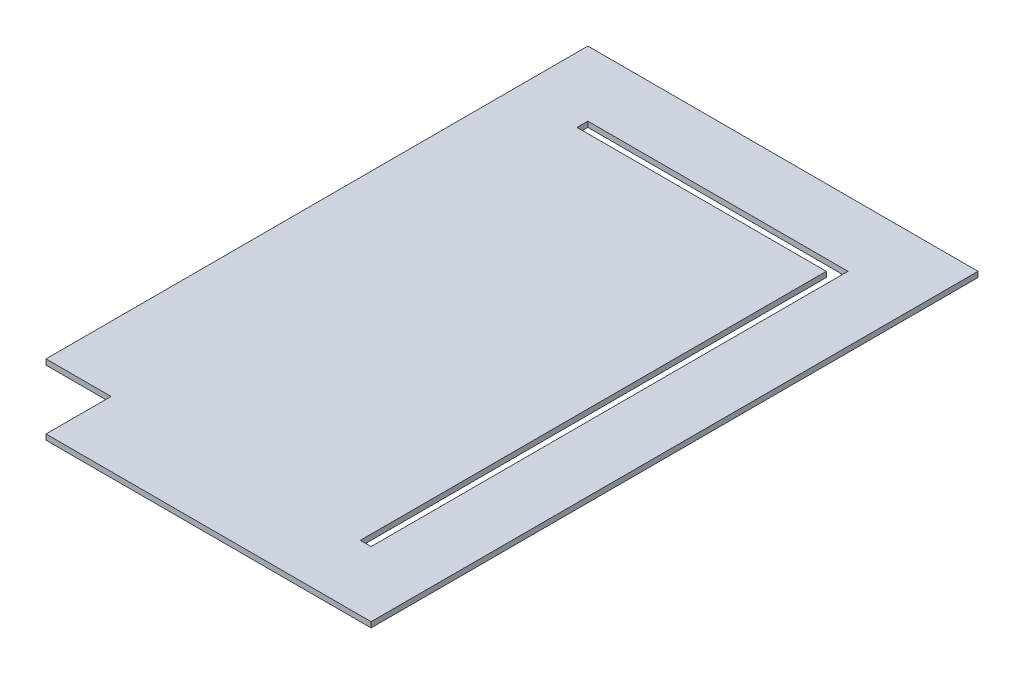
ISO-10303-21;
HEADER;
FILE_DESCRIPTION(('STEP AP214'),'2;1');
FILE_NAME('part.step','',(''),(''),'','','');
FILE_SCHEMA(('AUTOMOTIVE_DESIGN { 1 0 10303 214 1 1 1 1 }'));
ENDSEC;
DATA;
#1=APPLICATION_CONTEXT('core data for automotive mechanical design processes');
#2=APPLICATION_PROTOCOL_DEFINITION('international standard','automotive_design',2000,#1);
#3=PRODUCT_CONTEXT('',#1,'mechanical');
#4=PRODUCT('Part','Part','',(#3));
#5=PRODUCT_RELATED_PRODUCT_CATEGORY('part','',(#4));
#6=PRODUCT_DEFINITION_FORMATION('','',#4);
#7=PRODUCT_DEFINITION_CONTEXT('part definition',#1,'design');
#8=PRODUCT_DEFINITION('design','',#6,#7);
#9=PRODUCT_DEFINITION_SHAPE('','',#8);
#10=(LENGTH_UNIT() NAMED_UNIT(*) SI_UNIT(.MILLI.,.METRE.));
#11=(NAMED_UNIT(*) PLANE_ANGLE_UNIT() SI_UNIT($,.RADIAN.));
#12=(NAMED_UNIT(*) SI_UNIT($,.STERADIAN.) SOLID_ANGLE_UNIT());
#13=UNCERTAINTY_MEASURE_WITH_UNIT(LENGTH_MEASURE(1.E-05),#10,'distance_accuracy_value','');
#14=(GEOMETRIC_REPRESENTATION_CONTEXT(3) GLOBAL_UNCERTAINTY_ASSIGNED_CONTEXT((#13)) GLOBAL_UNIT_ASSIGNED_CONTEXT((#10,
#11,#12)) REPRESENTATION_CONTEXT('',''));
#15=CARTESIAN_POINT('',(0.,0.,0.));
#16=DIRECTION('',(0.,0.,1.));
#17=DIRECTION('',(1.,0.,0.));
#18=AXIS2_PLACEMENT_3D('',#15,#16,#17);
#19=CARTESIAN_POINT('',(0.,3.175,0.));
#20=DIRECTION('',(0.,-1.,0.));
#21=DIRECTION('',(0.,0.,-1.));
#22=AXIS2_PLACEMENT_3D('',#19,#20,#21);
#23=PLANE('',#22);
#24=DIRECTION('',(0.,0.,1.));
#25=VECTOR('',#24,1.);
#26=CARTESIAN_POINT('',(-114.3,3.175,177.8));
#27=LINE('',#26,#25);
#28=CARTESIAN_POINT('',(-114.3,3.175,-177.8));
#29=VERTEX_POINT('',#28);
#30=CARTESIAN_POINT('',(-114.3,3.175,139.7));
#31=VERTEX_POINT('',#30);
#32=EDGE_CURVE('E232',#29,#31,#27,.T.);
#33=ORIENTED_EDGE('',*,*,#32,.T.);
#34=DIRECTION('',(-1.,0.,0.));
#35=VECTOR('',#34,1.);
#36=CARTESIAN_POINT('',(-114.3,3.175,139.7));
#37=LINE('',#36,#35);
#38=CARTESIAN_POINT('',(-76.2,3.175,139.7));
#39=VERTEX_POINT('',#38);
#40=EDGE_CURVE('E175',#39,#31,#37,.T.);
#41=ORIENTED_EDGE('',*,*,#40,.F.);
#42=DIRECTION('',(0.,0.,-1.));
#43=VECTOR('',#42,1.);
#44=CARTESIAN_POINT('',(-76.2,3.175,177.8));
#45=LINE('',#44,#43);
#46=CARTESIAN_POINT('',(-76.2,3.175,177.8));
#47=VERTEX_POINT('',#46);
#48=EDGE_CURVE('E156',#47,#39,#45,.T.);
#49=ORIENTED_EDGE('',*,*,#48,.F.);
#50=DIRECTION('',(1.,0.,0.));
#51=VECTOR('',#50,1.);
#52=CARTESIAN_POINT('',(-114.3,3.175,177.8));
#53=LINE('',#52,#51);
#54=CARTESIAN_POINT('',(114.3,3.175,177.8));
#55=VERTEX_POINT('',#54);
#56=EDGE_CURVE('E235',#47,#55,#53,.T.);
#57=ORIENTED_EDGE('',*,*,#56,.T.);
#58=DIRECTION('',(0.,0.,-1.));
#59=VECTOR('',#58,1.);
#60=CARTESIAN_POINT('',(114.3,3.175,177.8));
#61=LINE('',#60,#59);
#62=CARTESIAN_POINT('',(114.3,3.175,-177.8));
#63=VERTEX_POINT('',#62);
#64=EDGE_CURVE('E227',#55,#63,#61,.T.);
#65=ORIENTED_EDGE('',*,*,#64,.T.);
#66=DIRECTION('',(-1.,0.,0.));
#67=VECTOR('',#66,1.);
#68=CARTESIAN_POINT('',(-114.3,3.175,-177.8));
#69=LINE('',#68,#67);
#70=EDGE_CURVE('E230',#63,#29,#69,.T.);
#71=ORIENTED_EDGE('',*,*,#70,.T.);
#72=EDGE_LOOP('',(#33,#41,#49,#57,#65,#71));
#73=FACE_BOUND('',#72,.T.);
#74=DIRECTION('',(1.,0.,0.));
#75=VECTOR('',#74,1.);
#76=CARTESIAN_POINT('',(-76.2,3.175,-139.7));
#77=LINE('',#76,#75);
#78=CARTESIAN_POINT('',(-76.2,3.175,-139.7));
#79=VERTEX_POINT('',#78);
#80=CARTESIAN_POINT('',(76.2,3.175,-139.7));
#81=VERTEX_POINT('',#80);
#82=EDGE_CURVE('E200',#79,#81,#77,.T.);
#83=ORIENTED_EDGE('',*,*,#82,.T.);
#84=DIRECTION('',(0.,0.,1.));
#85=VECTOR('',#84,1.);
#86=CARTESIAN_POINT('',(76.2,3.175,-139.7));
#87=LINE('',#86,#85);
#88=CARTESIAN_POINT('',(76.2000000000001,3.175,139.7));
#89=VERTEX_POINT('',#88);
#90=EDGE_CURVE('E196',#81,#89,#87,.T.);
#91=ORIENTED_EDGE('',*,*,#90,.T.);
#92=DIRECTION('',(-1.,0.,0.));
#93=VECTOR('',#92,1.);
#94=CARTESIAN_POINT('',(76.2000000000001,3.175,139.7));
#95=LINE('',#94,#93);
#96=CARTESIAN_POINT('',(69.85,3.175,139.7));
#97=VERTEX_POINT('',#96);
#98=EDGE_CURVE('E180',#89,#97,#95,.T.);
#99=ORIENTED_EDGE('',*,*,#98,.T.);
#100=DIRECTION('',(0.,0.,1.));
#101=VECTOR('',#100,1.);
#102=CARTESIAN_POINT('',(69.85,3.175,-133.35));
#103=LINE('',#102,#101);
#104=CARTESIAN_POINT('',(69.85,3.175,-133.35));
#105=VERTEX_POINT('',#104);
#106=EDGE_CURVE('E215',#105,#97,#103,.T.);
#107=ORIENTED_EDGE('',*,*,#106,.F.);
#108=DIRECTION('',(1.,0.,0.));
#109=VECTOR('',#108,1.);
#110=CARTESIAN_POINT('',(-76.2,3.175,-133.35));
#111=LINE('',#110,#109);
#112=CARTESIAN_POINT('',(-76.2,3.175,-133.35));
#113=VERTEX_POINT('',#112);
#114=EDGE_CURVE('E88',#113,#105,#111,.T.);
#115=ORIENTED_EDGE('',*,*,#114,.F.);
#116=DIRECTION('',(0.,0.,1.));
#117=VECTOR('',#116,1.);
#118=CARTESIAN_POINT('',(-76.2,3.175,-139.7));
#119=LINE('',#118,#117);
#120=EDGE_CURVE('E187',#79,#113,#119,.T.);
#121=ORIENTED_EDGE('',*,*,#120,.F.);
#122=EDGE_LOOP('',(#83,#91,#99,#107,#115,#121));
#123=FACE_BOUND('',#122,.T.);
#124=ADVANCED_FACE('F65',(#73,#123),#23,.F.);
#125=CARTESIAN_POINT('',(0.,0.,0.));
#126=DIRECTION('',(0.,-1.,0.));
#127=DIRECTION('',(0.,0.,-1.));
#128=AXIS2_PLACEMENT_3D('',#125,#126,#127);
#129=PLANE('',#128);
#130=DIRECTION('',(-1.,0.,0.));
#131=VECTOR('',#130,1.);
#132=CARTESIAN_POINT('',(-114.3,0.,139.7));
#133=LINE('',#132,#131);
#134=CARTESIAN_POINT('',(-76.2,0.,139.7));
#135=VERTEX_POINT('',#134);
#136=CARTESIAN_POINT('',(-114.3,0.,139.7));
#137=VERTEX_POINT('',#136);
#138=EDGE_CURVE('E163',#135,#137,#133,.T.);
#139=ORIENTED_EDGE('',*,*,#138,.T.);
#140=DIRECTION('',(0.,0.,1.));
#141=VECTOR('',#140,1.);
#142=CARTESIAN_POINT('',(-114.3,0.,177.8));
#143=LINE('',#142,#141);
#144=CARTESIAN_POINT('',(-114.3,0.,-177.8));
#145=VERTEX_POINT('',#144);
#146=EDGE_CURVE('E242',#145,#137,#143,.T.);
#147=ORIENTED_EDGE('',*,*,#146,.F.);
#148=DIRECTION('',(-1.,0.,0.));
#149=VECTOR('',#148,1.);
#150=CARTESIAN_POINT('',(-114.3,0.,-177.8));
#151=LINE('',#150,#149);
#152=CARTESIAN_POINT('',(114.3,0.,-177.8));
#153=VERTEX_POINT('',#152);
#154=EDGE_CURVE('E240',#153,#145,#151,.T.);
#155=ORIENTED_EDGE('',*,*,#154,.F.);
#156=DIRECTION('',(0.,0.,-1.));
#157=VECTOR('',#156,1.);
#158=CARTESIAN_POINT('',(114.3,0.,177.8));
#159=LINE('',#158,#157);
#160=CARTESIAN_POINT('',(114.3,0.,177.8));
#161=VERTEX_POINT('',#160);
#162=EDGE_CURVE('E225',#161,#153,#159,.T.);
#163=ORIENTED_EDGE('',*,*,#162,.F.);
#164=DIRECTION('',(1.,0.,0.));
#165=VECTOR('',#164,1.);
#166=CARTESIAN_POINT('',(-114.3,0.,177.8));
#167=LINE('',#166,#165);
#168=CARTESIAN_POINT('',(-76.2,0.,177.8));
#169=VERTEX_POINT('',#168);
#170=EDGE_CURVE('E174',#169,#161,#167,.T.);
#171=ORIENTED_EDGE('',*,*,#170,.F.);
#172=DIRECTION('',(0.,0.,-1.));
#173=VECTOR('',#172,1.);
#174=CARTESIAN_POINT('',(-76.2,0.,177.8));
#175=LINE('',#174,#173);
#176=EDGE_CURVE('E80',#169,#135,#175,.T.);
#177=ORIENTED_EDGE('',*,*,#176,.T.);
#178=EDGE_LOOP('',(#139,#147,#155,#163,#171,#177));
#179=FACE_BOUND('',#178,.T.);
#180=DIRECTION('',(0.,0.,1.));
#181=VECTOR('',#180,1.);
#182=CARTESIAN_POINT('',(76.2,0.,-139.7));
#183=LINE('',#182,#181);
#184=CARTESIAN_POINT('',(76.2,0.,-139.7));
#185=VERTEX_POINT('',#184);
#186=CARTESIAN_POINT('',(76.2000000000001,0.,139.7));
#187=VERTEX_POINT('',#186);
#188=EDGE_CURVE('E186',#185,#187,#183,.T.);
#189=ORIENTED_EDGE('',*,*,#188,.F.);
#190=DIRECTION('',(1.,0.,0.));
#191=VECTOR('',#190,1.);
#192=CARTESIAN_POINT('',(-76.2,0.,-139.7));
#193=LINE('',#192,#191);
#194=CARTESIAN_POINT('',(-76.2,0.,-139.7));
#195=VERTEX_POINT('',#194);
#196=EDGE_CURVE('E189',#195,#185,#193,.T.);
#197=ORIENTED_EDGE('',*,*,#196,.F.);
#198=DIRECTION('',(0.,0.,1.));
#199=VECTOR('',#198,1.);
#200=CARTESIAN_POINT('',(-76.2,0.,-139.7));
#201=LINE('',#200,#199);
#202=CARTESIAN_POINT('',(-76.2,0.,-133.35));
#203=VERTEX_POINT('',#202);
#204=EDGE_CURVE('E191',#195,#203,#201,.T.);
#205=ORIENTED_EDGE('',*,*,#204,.T.);
#206=DIRECTION('',(1.,0.,0.));
#207=VECTOR('',#206,1.);
#208=CARTESIAN_POINT('',(-76.2,0.,-133.35));
#209=LINE('',#208,#207);
#210=CARTESIAN_POINT('',(69.8499999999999,0.,-133.35));
#211=VERTEX_POINT('',#210);
#212=EDGE_CURVE('E183',#203,#211,#209,.T.);
#213=ORIENTED_EDGE('',*,*,#212,.T.);
#214=DIRECTION('',(0.,0.,1.));
#215=VECTOR('',#214,1.);
#216=CARTESIAN_POINT('',(69.85,0.,-133.35));
#217=LINE('',#216,#215);
#218=CARTESIAN_POINT('',(69.85,0.,139.7));
#219=VERTEX_POINT('',#218);
#220=EDGE_CURVE('E214',#211,#219,#217,.T.);
#221=ORIENTED_EDGE('',*,*,#220,.T.);
#222=DIRECTION('',(-1.,0.,0.));
#223=VECTOR('',#222,1.);
#224=CARTESIAN_POINT('',(76.2000000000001,0.,139.7));
#225=LINE('',#224,#223);
#226=EDGE_CURVE('E211',#187,#219,#225,.T.);
#227=ORIENTED_EDGE('',*,*,#226,.F.);
#228=EDGE_LOOP('',(#189,#197,#205,#213,#221,#227));
#229=FACE_BOUND('',#228,.T.);
#230=ADVANCED_FACE('F171',(#179,#229),#129,.T.);
#231=CARTESIAN_POINT('',(114.3,3.175,177.8));
#232=DIRECTION('',(-1.,0.,0.));
#233=DIRECTION('',(0.,0.,1.));
#234=AXIS2_PLACEMENT_3D('',#231,#232,#233);
#235=PLANE('',#234);
#236=ORIENTED_EDGE('',*,*,#162,.T.);
#237=DIRECTION('',(0.,-1.,0.));
#238=VECTOR('',#237,1.);
#239=CARTESIAN_POINT('',(114.3,3.175,-177.8));
#240=LINE('',#239,#238);
#241=EDGE_CURVE('E12',#63,#153,#240,.T.);
#242=ORIENTED_EDGE('',*,*,#241,.F.);
#243=ORIENTED_EDGE('',*,*,#64,.F.);
#244=DIRECTION('',(0.,-1.,0.));
#245=VECTOR('',#244,1.);
#246=CARTESIAN_POINT('',(114.3,3.175,177.8));
#247=LINE('',#246,#245);
#248=EDGE_CURVE('E237',#55,#161,#247,.T.);
#249=ORIENTED_EDGE('',*,*,#248,.T.);
#250=EDGE_LOOP('',(#236,#242,#243,#249));
#251=FACE_BOUND('',#250,.T.);
#252=ADVANCED_FACE('F67',(#251),#235,.F.);
#253=CARTESIAN_POINT('',(-114.3,3.175,-177.8));
#254=DIRECTION('',(0.,0.,1.));
#255=DIRECTION('',(1.,0.,0.));
#256=AXIS2_PLACEMENT_3D('',#253,#254,#255);
#257=PLANE('',#256);
#258=ORIENTED_EDGE('',*,*,#154,.T.);
#259=DIRECTION('',(0.,-1.,0.));
#260=VECTOR('',#259,1.);
#261=CARTESIAN_POINT('',(-114.3,3.175,-177.8));
#262=LINE('',#261,#260);
#263=EDGE_CURVE('E73',#29,#145,#262,.T.);
#264=ORIENTED_EDGE('',*,*,#263,.F.);
#265=ORIENTED_EDGE('',*,*,#70,.F.);
#266=ORIENTED_EDGE('',*,*,#241,.T.);
#267=EDGE_LOOP('',(#258,#264,#265,#266));
#268=FACE_BOUND('',#267,.T.);
#269=ADVANCED_FACE('F253',(#268),#257,.F.);
#270=CARTESIAN_POINT('',(-114.3,3.175,177.8));
#271=DIRECTION('',(1.,0.,0.));
#272=DIRECTION('',(0.,0.,-1.));
#273=AXIS2_PLACEMENT_3D('',#270,#271,#272);
#274=PLANE('',#273);
#275=ORIENTED_EDGE('',*,*,#146,.T.);
#276=DIRECTION('',(0.,1.,0.));
#277=VECTOR('',#276,1.);
#278=CARTESIAN_POINT('',(-114.3,0.,139.7));
#279=LINE('',#278,#277);
#280=EDGE_CURVE('E159',#137,#31,#279,.T.);
#281=ORIENTED_EDGE('',*,*,#280,.T.);
#282=ORIENTED_EDGE('',*,*,#32,.F.);
#283=ORIENTED_EDGE('',*,*,#263,.T.);
#284=EDGE_LOOP('',(#275,#281,#282,#283));
#285=FACE_BOUND('',#284,.T.);
#286=ADVANCED_FACE('F250',(#285),#274,.F.);
#287=CARTESIAN_POINT('',(-114.3,3.175,177.8));
#288=DIRECTION('',(0.,0.,-1.));
#289=DIRECTION('',(-1.,0.,0.));
#290=AXIS2_PLACEMENT_3D('',#287,#288,#289);
#291=PLANE('',#290);
#292=ORIENTED_EDGE('',*,*,#56,.F.);
#293=DIRECTION('',(0.,1.,0.));
#294=VECTOR('',#293,1.);
#295=CARTESIAN_POINT('',(-76.2,0.,177.8));
#296=LINE('',#295,#294);
#297=EDGE_CURVE('E160',#169,#47,#296,.T.);
#298=ORIENTED_EDGE('',*,*,#297,.F.);
#299=ORIENTED_EDGE('',*,*,#170,.T.);
#300=ORIENTED_EDGE('',*,*,#248,.F.);
#301=EDGE_LOOP('',(#292,#298,#299,#300));
#302=FACE_BOUND('',#301,.T.);
#303=ADVANCED_FACE('F259',(#302),#291,.F.);
#304=CARTESIAN_POINT('',(-76.2,0.,-139.7));
#305=DIRECTION('',(0.,0.,1.));
#306=DIRECTION('',(1.,0.,0.));
#307=AXIS2_PLACEMENT_3D('',#304,#305,#306);
#308=PLANE('',#307);
#309=ORIENTED_EDGE('',*,*,#82,.F.);
#310=DIRECTION('',(0.,1.,0.));
#311=VECTOR('',#310,1.);
#312=CARTESIAN_POINT('',(-76.2,0.,-139.7));
#313=LINE('',#312,#311);
#314=EDGE_CURVE('E208',#195,#79,#313,.T.);
#315=ORIENTED_EDGE('',*,*,#314,.F.);
#316=ORIENTED_EDGE('',*,*,#196,.T.);
#317=DIRECTION('',(0.,1.,0.));
#318=VECTOR('',#317,1.);
#319=CARTESIAN_POINT('',(76.2,0.,-139.7));
#320=LINE('',#319,#318);
#321=EDGE_CURVE('E194',#185,#81,#320,.T.);
#322=ORIENTED_EDGE('',*,*,#321,.T.);
#323=EDGE_LOOP('',(#309,#315,#316,#322));
#324=FACE_BOUND('',#323,.T.);
#325=ADVANCED_FACE('F268',(#324),#308,.T.);
#326=CARTESIAN_POINT('',(-76.2,0.,-139.7));
#327=DIRECTION('',(-1.,0.,0.));
#328=DIRECTION('',(0.,0.,1.));
#329=AXIS2_PLACEMENT_3D('',#326,#327,#328);
#330=PLANE('',#329);
#331=ORIENTED_EDGE('',*,*,#120,.T.);
#332=DIRECTION('',(0.,1.,0.));
#333=VECTOR('',#332,1.);
#334=CARTESIAN_POINT('',(-76.2,0.,-133.35));
#335=LINE('',#334,#333);
#336=EDGE_CURVE('E205',#203,#113,#335,.T.);
#337=ORIENTED_EDGE('',*,*,#336,.F.);
#338=ORIENTED_EDGE('',*,*,#204,.F.);
#339=ORIENTED_EDGE('',*,*,#314,.T.);
#340=EDGE_LOOP('',(#331,#337,#338,#339));
#341=FACE_BOUND('',#340,.T.);
#342=ADVANCED_FACE('F287',(#341),#330,.F.);
#343=CARTESIAN_POINT('',(-76.2,0.,-133.35));
#344=DIRECTION('',(0.,0.,1.));
#345=DIRECTION('',(1.,0.,0.));
#346=AXIS2_PLACEMENT_3D('',#343,#344,#345);
#347=PLANE('',#346);
#348=ORIENTED_EDGE('',*,*,#212,.F.);
#349=ORIENTED_EDGE('',*,*,#336,.T.);
#350=ORIENTED_EDGE('',*,*,#114,.T.);
#351=DIRECTION('',(0.,1.,0.));
#352=VECTOR('',#351,1.);
#353=CARTESIAN_POINT('',(69.85,0.,-133.35));
#354=LINE('',#353,#352);
#355=EDGE_CURVE('E207',#211,#105,#354,.T.);
#356=ORIENTED_EDGE('',*,*,#355,.F.);
#357=EDGE_LOOP('',(#348,#349,#350,#356));
#358=FACE_BOUND('',#357,.T.);
#359=ADVANCED_FACE('F285',(#358),#347,.F.);
#360=CARTESIAN_POINT('',(76.2,0.,-139.7));
#361=DIRECTION('',(-1.,0.,0.));
#362=DIRECTION('',(0.,0.,1.));
#363=AXIS2_PLACEMENT_3D('',#360,#361,#362);
#364=PLANE('',#363);
#365=ORIENTED_EDGE('',*,*,#90,.F.);
#366=ORIENTED_EDGE('',*,*,#321,.F.);
#367=ORIENTED_EDGE('',*,*,#188,.T.);
#368=DIRECTION('',(0.,1.,0.));
#369=VECTOR('',#368,1.);
#370=CARTESIAN_POINT('',(76.2000000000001,0.,139.7));
#371=LINE('',#370,#369);
#372=EDGE_CURVE('E218',#187,#89,#371,.T.);
#373=ORIENTED_EDGE('',*,*,#372,.T.);
#374=EDGE_LOOP('',(#365,#366,#367,#373));
#375=FACE_BOUND('',#374,.T.);
#376=ADVANCED_FACE('F274',(#375),#364,.T.);
#377=CARTESIAN_POINT('',(76.2000000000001,0.,139.7));
#378=DIRECTION('',(0.,0.,-1.));
#379=DIRECTION('',(-1.,0.,0.));
#380=AXIS2_PLACEMENT_3D('',#377,#378,#379);
#381=PLANE('',#380);
#382=ORIENTED_EDGE('',*,*,#98,.F.);
#383=ORIENTED_EDGE('',*,*,#372,.F.);
#384=ORIENTED_EDGE('',*,*,#226,.T.);
#385=DIRECTION('',(0.,1.,0.));
#386=VECTOR('',#385,1.);
#387=CARTESIAN_POINT('',(69.85,0.,139.7));
#388=LINE('',#387,#386);
#389=EDGE_CURVE('E197',#219,#97,#388,.T.);
#390=ORIENTED_EDGE('',*,*,#389,.T.);
#391=EDGE_LOOP('',(#382,#383,#384,#390));
#392=FACE_BOUND('',#391,.T.);
#393=ADVANCED_FACE('F279',(#392),#381,.T.);
#394=CARTESIAN_POINT('',(69.85,0.,-133.35));
#395=DIRECTION('',(-1.,0.,0.));
#396=DIRECTION('',(0.,0.,1.));
#397=AXIS2_PLACEMENT_3D('',#394,#395,#396);
#398=PLANE('',#397);
#399=ORIENTED_EDGE('',*,*,#106,.T.);
#400=ORIENTED_EDGE('',*,*,#389,.F.);
#401=ORIENTED_EDGE('',*,*,#220,.F.);
#402=ORIENTED_EDGE('',*,*,#355,.T.);
#403=EDGE_LOOP('',(#399,#400,#401,#402));
#404=FACE_BOUND('',#403,.T.);
#405=ADVANCED_FACE('F282',(#404),#398,.F.);
#406=CARTESIAN_POINT('',(-114.3,0.,139.7));
#407=DIRECTION('',(0.,0.,-1.));
#408=DIRECTION('',(-1.,0.,0.));
#409=AXIS2_PLACEMENT_3D('',#406,#407,#408);
#410=PLANE('',#409);
#411=ORIENTED_EDGE('',*,*,#40,.T.);
#412=ORIENTED_EDGE('',*,*,#280,.F.);
#413=ORIENTED_EDGE('',*,*,#138,.F.);
#414=DIRECTION('',(0.,1.,0.));
#415=VECTOR('',#414,1.);
#416=CARTESIAN_POINT('',(-76.2,0.,139.7));
#417=LINE('',#416,#415);
#418=EDGE_CURVE('E152',#135,#39,#417,.T.);
#419=ORIENTED_EDGE('',*,*,#418,.T.);
#420=EDGE_LOOP('',(#411,#412,#413,#419));
#421=FACE_BOUND('',#420,.T.);
#422=ADVANCED_FACE('F164',(#421),#410,.F.);
#423=CARTESIAN_POINT('',(-76.2,0.,177.8));
#424=DIRECTION('',(1.,0.,0.));
#425=DIRECTION('',(0.,0.,-1.));
#426=AXIS2_PLACEMENT_3D('',#423,#424,#425);
#427=PLANE('',#426);
#428=ORIENTED_EDGE('',*,*,#48,.T.);
#429=ORIENTED_EDGE('',*,*,#418,.F.);
#430=ORIENTED_EDGE('',*,*,#176,.F.);
#431=ORIENTED_EDGE('',*,*,#297,.T.);
#432=EDGE_LOOP('',(#428,#429,#430,#431));
#433=FACE_BOUND('',#432,.T.);
#434=ADVANCED_FACE('F154',(#433),#427,.F.);
#435=CLOSED_SHELL('',(#124,#230,#252,#269,#286,#303,#325,#342,#359,#376,#393,#405,#422,#434));
#436=MANIFOLD_SOLID_BREP('B2',#435);
#437=ADVANCED_BREP_SHAPE_REPRESENTATION('',(#18,#436),#14);
#438=SHAPE_DEFINITION_REPRESENTATION(#9,#437);
ENDSEC;
END-ISO-10303-21;
